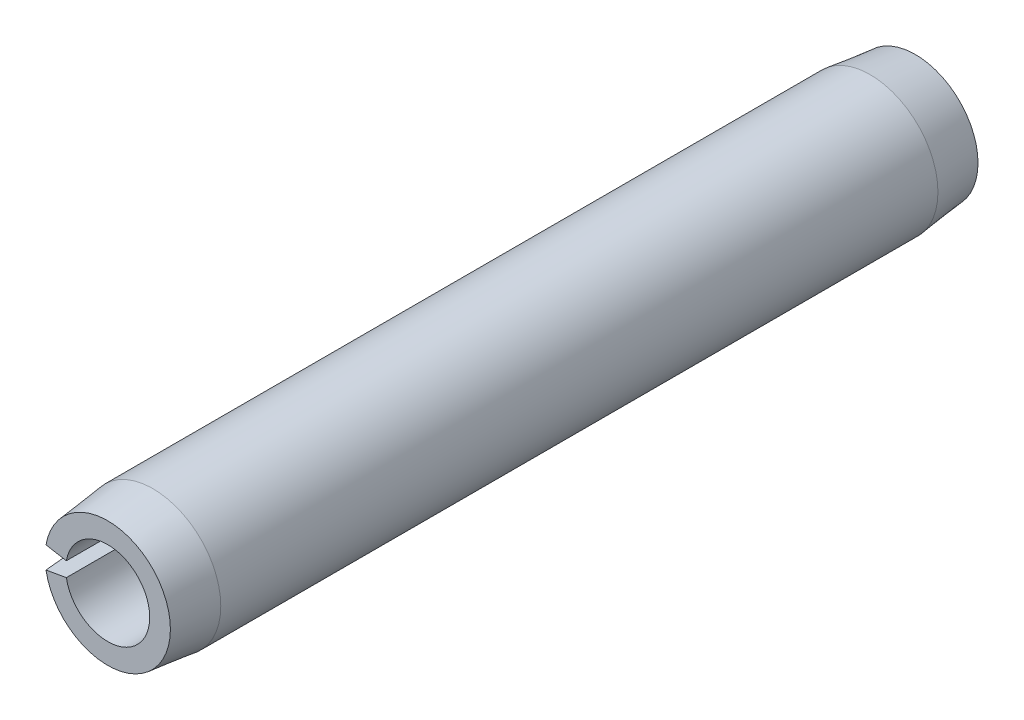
from build123d import *

# Parameters (mm, degrees)
EXTRUDE1_DEPTH      = 4.7625
EXTRUDE1_DEPTH_BACK = 4.7625


with BuildPart() as part:
    # Sketch1 → Extrude1 (new, two sides: drawn at the far end of the back side and taken through both)
    with BuildSketch(Plane.XY.offset(-EXTRUDE1_DEPTH_BACK)):
        with BuildLine():
            Line((-0.48777528, -0.086007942), (-0.787944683, -0.138935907))
            ThreePointArc((-0.787944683, -0.138935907), (0.8001, 0), (-0.787944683, 0.138935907))
            Line((-0.787944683, 0.138935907), (-0.48777528, 0.086007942))
            ThreePointArc((-0.48777528, 0.086007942), (0.4953, 0), (-0.48777528, -0.086007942))
        make_face()
    extrude(amount=EXTRUDE1_DEPTH + EXTRUDE1_DEPTH_BACK)

    # Sketch2 → Cut-Revolve1 (revolve, cut)
    with BuildSketch(Plane(origin=(0, 0, 0), x_dir=(0, 0, -1), z_dir=(1, 0, 0))):
        Polygon((4.7625, 0.73914), (4.2291, 0.8001), (4.7625, 0.8001), align=None)
    cut_revolve1 = revolve(axis=Axis((0, 0, -4.7625), (0, 0, 1)), mode=Mode.SUBTRACT)

    # Mirror1: Cut-Revolve1 across plane
    add(cut_revolve1.mirror(Plane.XY), mode=Mode.SUBTRACT)


solid = part.part
